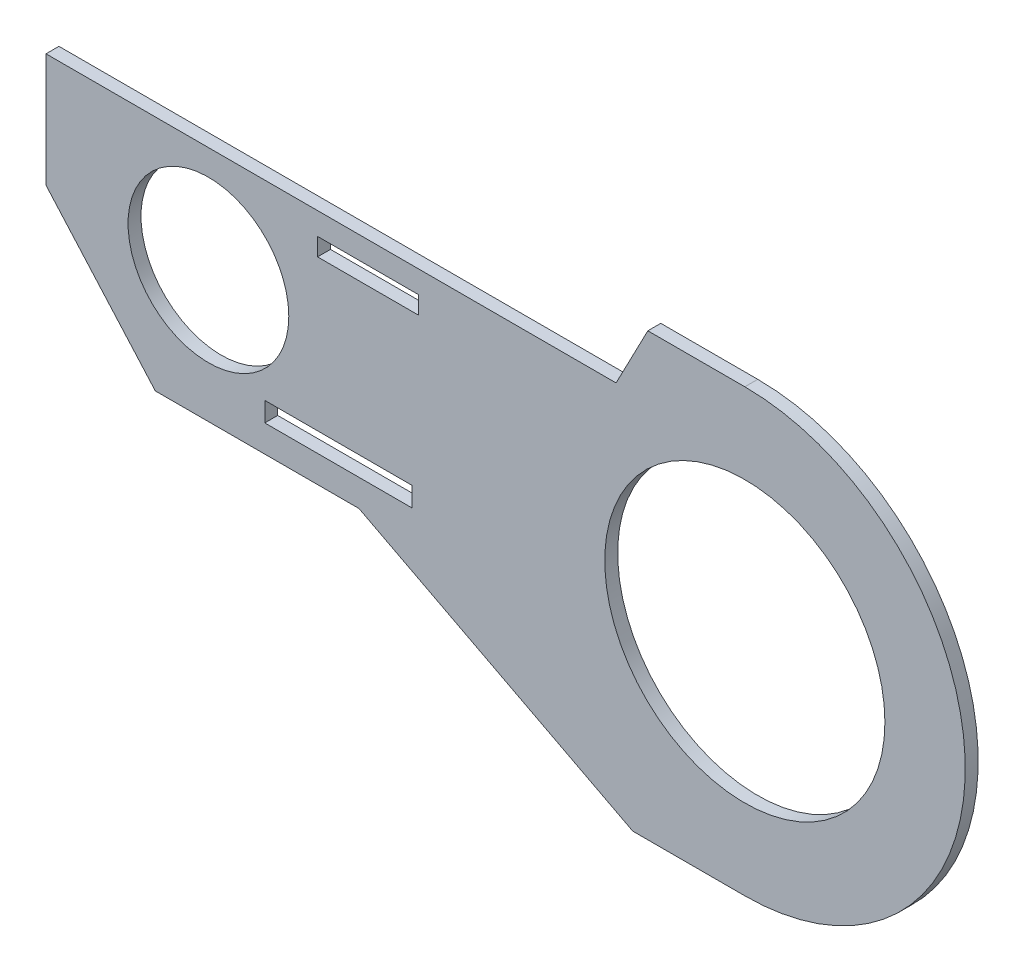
ISO-10303-21;
HEADER;
FILE_DESCRIPTION(('STEP AP214'),'2;1');
FILE_NAME('part.step','',(''),(''),'','','');
FILE_SCHEMA(('AUTOMOTIVE_DESIGN { 1 0 10303 214 1 1 1 1 }'));
ENDSEC;
DATA;
#1=APPLICATION_CONTEXT('core data for automotive mechanical design processes');
#2=APPLICATION_PROTOCOL_DEFINITION('international standard','automotive_design',2000,#1);
#3=PRODUCT_CONTEXT('',#1,'mechanical');
#4=PRODUCT('Part','Part','',(#3));
#5=PRODUCT_RELATED_PRODUCT_CATEGORY('part','',(#4));
#6=PRODUCT_DEFINITION_FORMATION('','',#4);
#7=PRODUCT_DEFINITION_CONTEXT('part definition',#1,'design');
#8=PRODUCT_DEFINITION('design','',#6,#7);
#9=PRODUCT_DEFINITION_SHAPE('','',#8);
#10=(LENGTH_UNIT() NAMED_UNIT(*) SI_UNIT(.MILLI.,.METRE.));
#11=(NAMED_UNIT(*) PLANE_ANGLE_UNIT() SI_UNIT($,.RADIAN.));
#12=(NAMED_UNIT(*) SI_UNIT($,.STERADIAN.) SOLID_ANGLE_UNIT());
#13=UNCERTAINTY_MEASURE_WITH_UNIT(LENGTH_MEASURE(1.E-05),#10,'distance_accuracy_value','');
#14=(GEOMETRIC_REPRESENTATION_CONTEXT(3) GLOBAL_UNCERTAINTY_ASSIGNED_CONTEXT((#13)) GLOBAL_UNIT_ASSIGNED_CONTEXT((#10,
#11,#12)) REPRESENTATION_CONTEXT('',''));
#15=CARTESIAN_POINT('',(0.,0.,0.));
#16=DIRECTION('',(0.,0.,1.));
#17=DIRECTION('',(1.,0.,0.));
#18=AXIS2_PLACEMENT_3D('',#15,#16,#17);
#19=CARTESIAN_POINT('',(360.895292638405,72.8829236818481,12.1));
#20=DIRECTION('',(0.,0.,-1.));
#21=DIRECTION('',(-1.,0.,0.));
#22=AXIS2_PLACEMENT_3D('',#19,#20,#21);
#23=PLANE('',#22);
#24=CARTESIAN_POINT('',(360.895292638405,72.8829236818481,12.1));
#25=DIRECTION('',(0.,0.,1.));
#26=DIRECTION('',(1.,0.,0.));
#27=AXIS2_PLACEMENT_3D('',#24,#25,#26);
#28=CIRCLE('',#27,131.026924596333);
#29=CARTESIAN_POINT('',(491.922217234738,72.8829236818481,12.1));
#30=VERTEX_POINT('',#29);
#31=EDGE_CURVE('E190',#30,#30,#28,.T.);
#32=ORIENTED_EDGE('',*,*,#31,.F.);
#33=EDGE_LOOP('',(#32));
#34=FACE_BOUND('',#33,.T.);
#35=CARTESIAN_POINT('',(-140.807894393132,122.8435308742,12.1));
#36=DIRECTION('',(0.,0.,1.));
#37=DIRECTION('',(1.,0.,0.));
#38=AXIS2_PLACEMENT_3D('',#35,#36,#37);
#39=CIRCLE('',#38,75.166609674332);
#40=CARTESIAN_POINT('',(-65.6412847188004,122.8435308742,12.1));
#41=VERTEX_POINT('',#40);
#42=EDGE_CURVE('E196',#41,#41,#39,.T.);
#43=ORIENTED_EDGE('',*,*,#42,.F.);
#44=EDGE_LOOP('',(#43));
#45=FACE_BOUND('',#44,.T.);
#46=DIRECTION('',(0.,1.,0.));
#47=VECTOR('',#46,1.);
#48=CARTESIAN_POINT('',(49.4156994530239,43.5664611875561,12.1));
#49=LINE('',#48,#47);
#50=CARTESIAN_POINT('',(49.4156994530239,25.2820023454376,12.1));
#51=VERTEX_POINT('',#50);
#52=CARTESIAN_POINT('',(49.4156994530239,43.5664611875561,12.1));
#53=VERTEX_POINT('',#52);
#54=EDGE_CURVE('E202',#51,#53,#49,.T.);
#55=ORIENTED_EDGE('',*,*,#54,.F.);
#56=DIRECTION('',(1.,0.,0.));
#57=VECTOR('',#56,1.);
#58=CARTESIAN_POINT('',(-88.1032874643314,25.2820023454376,12.1));
#59=LINE('',#58,#57);
#60=CARTESIAN_POINT('',(-88.1032874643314,25.2820023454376,12.1));
#61=VERTEX_POINT('',#60);
#62=EDGE_CURVE('E210',#61,#51,#59,.T.);
#63=ORIENTED_EDGE('',*,*,#62,.F.);
#64=DIRECTION('',(0.,-1.,0.));
#65=VECTOR('',#64,1.);
#66=CARTESIAN_POINT('',(-88.1032874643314,43.5664611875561,12.1));
#67=LINE('',#66,#65);
#68=CARTESIAN_POINT('',(-88.1032874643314,43.5664611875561,12.1));
#69=VERTEX_POINT('',#68);
#70=EDGE_CURVE('E207',#69,#61,#67,.T.);
#71=ORIENTED_EDGE('',*,*,#70,.F.);
#72=DIRECTION('',(-1.,0.,0.));
#73=VECTOR('',#72,1.);
#74=CARTESIAN_POINT('',(-88.1032874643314,43.5664611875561,12.1));
#75=LINE('',#74,#73);
#76=EDGE_CURVE('E204',#53,#69,#75,.T.);
#77=ORIENTED_EDGE('',*,*,#76,.F.);
#78=EDGE_LOOP('',(#55,#63,#71,#77));
#79=FACE_BOUND('',#78,.T.);
#80=DIRECTION('',(1.,0.,0.));
#81=VECTOR('',#80,1.);
#82=CARTESIAN_POINT('',(-190.489812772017,0.,12.1));
#83=LINE('',#82,#81);
#84=CARTESIAN_POINT('',(-190.489812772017,0.,12.1));
#85=VERTEX_POINT('',#84);
#86=CARTESIAN_POINT('',(0.,0.,12.1));
#87=VERTEX_POINT('',#86);
#88=EDGE_CURVE('E233',#85,#87,#83,.T.);
#89=ORIENTED_EDGE('',*,*,#88,.T.);
#90=DIRECTION('',(0.887044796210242,-0.461683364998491,0.));
#91=VECTOR('',#90,1.);
#92=CARTESIAN_POINT('',(0.,0.,12.1));
#93=LINE('',#92,#91);
#94=CARTESIAN_POINT('',(256.094013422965,-133.290163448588,12.1));
#95=VERTEX_POINT('',#94);
#96=EDGE_CURVE('E236',#87,#95,#93,.T.);
#97=ORIENTED_EDGE('',*,*,#96,.T.);
#98=DIRECTION('',(1.,0.,0.));
#99=VECTOR('',#98,1.);
#100=CARTESIAN_POINT('',(256.094013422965,-133.290163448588,12.1));
#101=LINE('',#100,#99);
#102=CARTESIAN_POINT('',(360.895292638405,-133.290163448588,12.1));
#103=VERTEX_POINT('',#102);
#104=EDGE_CURVE('E239',#95,#103,#101,.T.);
#105=ORIENTED_EDGE('',*,*,#104,.T.);
#106=CARTESIAN_POINT('',(360.895292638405,72.8829236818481,12.1));
#107=DIRECTION('',(0.,0.,1.));
#108=DIRECTION('',(-1.,0.,0.));
#109=AXIS2_PLACEMENT_3D('',#106,#107,#108);
#110=CIRCLE('',#109,206.173087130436);
#111=CARTESIAN_POINT('',(360.895292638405,279.056010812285,12.1));
#112=VERTEX_POINT('',#111);
#113=EDGE_CURVE('E241',#103,#112,#110,.T.);
#114=ORIENTED_EDGE('',*,*,#113,.T.);
#115=DIRECTION('',(-1.,0.,0.));
#116=VECTOR('',#115,1.);
#117=CARTESIAN_POINT('',(360.895292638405,279.056010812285,12.1));
#118=LINE('',#117,#116);
#119=CARTESIAN_POINT('',(270.184556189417,279.056010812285,12.1));
#120=VERTEX_POINT('',#119);
#121=EDGE_CURVE('E243',#112,#120,#118,.T.);
#122=ORIENTED_EDGE('',*,*,#121,.T.);
#123=DIRECTION('',(-0.461683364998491,-0.887044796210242,0.));
#124=VECTOR('',#123,1.);
#125=CARTESIAN_POINT('',(270.184556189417,279.056010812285,12.1));
#126=LINE('',#125,#124);
#127=CARTESIAN_POINT('',(240.473508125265,221.971366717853,12.1));
#128=VERTEX_POINT('',#127);
#129=EDGE_CURVE('E245',#120,#128,#126,.T.);
#130=ORIENTED_EDGE('',*,*,#129,.T.);
#131=DIRECTION('',(-1.,0.,0.));
#132=VECTOR('',#131,1.);
#133=CARTESIAN_POINT('',(240.473508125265,221.971366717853,12.1));
#134=LINE('',#133,#132);
#135=CARTESIAN_POINT('',(-292.728145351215,221.971366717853,12.1));
#136=VERTEX_POINT('',#135);
#137=EDGE_CURVE('E247',#128,#136,#134,.T.);
#138=ORIENTED_EDGE('',*,*,#137,.T.);
#139=DIRECTION('',(0.,-1.,0.));
#140=VECTOR('',#139,1.);
#141=CARTESIAN_POINT('',(-292.728145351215,221.971366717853,12.1));
#142=LINE('',#141,#140);
#143=CARTESIAN_POINT('',(-292.728145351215,115.500270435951,12.1));
#144=VERTEX_POINT('',#143);
#145=EDGE_CURVE('E249',#136,#144,#142,.T.);
#146=ORIENTED_EDGE('',*,*,#145,.T.);
#147=DIRECTION('',(0.662810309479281,-0.74878734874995,0.));
#148=VECTOR('',#147,1.);
#149=CARTESIAN_POINT('',(-292.728145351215,115.500270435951,12.1));
#150=LINE('',#149,#148);
#151=EDGE_CURVE('E251',#144,#85,#150,.T.);
#152=ORIENTED_EDGE('',*,*,#151,.T.);
#153=EDGE_LOOP('',(#89,#97,#105,#114,#122,#130,#138,#146,#152));
#154=FACE_BOUND('',#153,.T.);
#155=DIRECTION('',(0.,1.,0.));
#156=VECTOR('',#155,1.);
#157=CARTESIAN_POINT('',(55.6816381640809,201.057980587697,12.1));
#158=LINE('',#157,#156);
#159=CARTESIAN_POINT('',(55.6816381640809,184.471071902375,12.1));
#160=VERTEX_POINT('',#159);
#161=CARTESIAN_POINT('',(55.6816381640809,201.057980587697,12.1));
#162=VERTEX_POINT('',#161);
#163=EDGE_CURVE('E154',#160,#162,#158,.T.);
#164=ORIENTED_EDGE('',*,*,#163,.F.);
#165=DIRECTION('',(1.,0.,0.));
#166=VECTOR('',#165,1.);
#167=CARTESIAN_POINT('',(-38.736149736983,184.471071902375,12.1));
#168=LINE('',#167,#166);
#169=CARTESIAN_POINT('',(-38.736149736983,184.471071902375,12.1));
#170=VERTEX_POINT('',#169);
#171=EDGE_CURVE('E176',#170,#160,#168,.T.);
#172=ORIENTED_EDGE('',*,*,#171,.F.);
#173=DIRECTION('',(0.,-1.,0.));
#174=VECTOR('',#173,1.);
#175=CARTESIAN_POINT('',(-38.736149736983,201.057980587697,12.1));
#176=LINE('',#175,#174);
#177=CARTESIAN_POINT('',(-38.736149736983,201.057980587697,12.1));
#178=VERTEX_POINT('',#177);
#179=EDGE_CURVE('E174',#178,#170,#176,.T.);
#180=ORIENTED_EDGE('',*,*,#179,.F.);
#181=DIRECTION('',(-1.,0.,0.));
#182=VECTOR('',#181,1.);
#183=CARTESIAN_POINT('',(-38.736149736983,201.057980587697,12.1));
#184=LINE('',#183,#182);
#185=EDGE_CURVE('E162',#162,#178,#184,.T.);
#186=ORIENTED_EDGE('',*,*,#185,.F.);
#187=EDGE_LOOP('',(#164,#172,#180,#186));
#188=FACE_BOUND('',#187,.T.);
#189=ADVANCED_FACE('F35',(#34,#45,#79,#154,#188),#23,.F.);
#190=CARTESIAN_POINT('',(360.895292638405,72.8829236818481,0.));
#191=DIRECTION('',(0.,0.,-1.));
#192=DIRECTION('',(-1.,0.,0.));
#193=AXIS2_PLACEMENT_3D('',#190,#191,#192);
#194=PLANE('',#193);
#195=CARTESIAN_POINT('',(-140.807894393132,122.8435308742,0.));
#196=DIRECTION('',(0.,0.,1.));
#197=DIRECTION('',(1.,0.,0.));
#198=AXIS2_PLACEMENT_3D('',#195,#196,#197);
#199=CIRCLE('',#198,75.166609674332);
#200=CARTESIAN_POINT('',(-65.6412847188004,122.8435308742,0.));
#201=VERTEX_POINT('',#200);
#202=EDGE_CURVE('E193',#201,#201,#199,.T.);
#203=ORIENTED_EDGE('',*,*,#202,.T.);
#204=EDGE_LOOP('',(#203));
#205=FACE_BOUND('',#204,.T.);
#206=DIRECTION('',(1.,0.,0.));
#207=VECTOR('',#206,1.);
#208=CARTESIAN_POINT('',(-190.489812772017,0.,0.));
#209=LINE('',#208,#207);
#210=CARTESIAN_POINT('',(-190.489812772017,0.,0.));
#211=VERTEX_POINT('',#210);
#212=CARTESIAN_POINT('',(0.,0.,0.));
#213=VERTEX_POINT('',#212);
#214=EDGE_CURVE('E232',#211,#213,#209,.T.);
#215=ORIENTED_EDGE('',*,*,#214,.F.);
#216=DIRECTION('',(0.662810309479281,-0.74878734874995,0.));
#217=VECTOR('',#216,1.);
#218=CARTESIAN_POINT('',(-292.728145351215,115.500270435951,0.));
#219=LINE('',#218,#217);
#220=CARTESIAN_POINT('',(-292.728145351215,115.500270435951,0.));
#221=VERTEX_POINT('',#220);
#222=EDGE_CURVE('E237',#221,#211,#219,.T.);
#223=ORIENTED_EDGE('',*,*,#222,.F.);
#224=DIRECTION('',(0.,-1.,0.));
#225=VECTOR('',#224,1.);
#226=CARTESIAN_POINT('',(-292.728145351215,221.971366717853,0.));
#227=LINE('',#226,#225);
#228=CARTESIAN_POINT('',(-292.728145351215,221.971366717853,0.));
#229=VERTEX_POINT('',#228);
#230=EDGE_CURVE('E268',#229,#221,#227,.T.);
#231=ORIENTED_EDGE('',*,*,#230,.F.);
#232=DIRECTION('',(-1.,0.,0.));
#233=VECTOR('',#232,1.);
#234=CARTESIAN_POINT('',(240.473508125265,221.971366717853,0.));
#235=LINE('',#234,#233);
#236=CARTESIAN_POINT('',(240.473508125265,221.971366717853,0.));
#237=VERTEX_POINT('',#236);
#238=EDGE_CURVE('E266',#237,#229,#235,.T.);
#239=ORIENTED_EDGE('',*,*,#238,.F.);
#240=DIRECTION('',(-0.461683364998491,-0.887044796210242,0.));
#241=VECTOR('',#240,1.);
#242=CARTESIAN_POINT('',(270.184556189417,279.056010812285,0.));
#243=LINE('',#242,#241);
#244=CARTESIAN_POINT('',(270.184556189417,279.056010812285,0.));
#245=VERTEX_POINT('',#244);
#246=EDGE_CURVE('E264',#245,#237,#243,.T.);
#247=ORIENTED_EDGE('',*,*,#246,.F.);
#248=DIRECTION('',(-1.,0.,0.));
#249=VECTOR('',#248,1.);
#250=CARTESIAN_POINT('',(360.895292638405,279.056010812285,0.));
#251=LINE('',#250,#249);
#252=CARTESIAN_POINT('',(360.895292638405,279.056010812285,0.));
#253=VERTEX_POINT('',#252);
#254=EDGE_CURVE('E262',#253,#245,#251,.T.);
#255=ORIENTED_EDGE('',*,*,#254,.F.);
#256=CARTESIAN_POINT('',(360.895292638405,72.8829236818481,0.));
#257=DIRECTION('',(0.,0.,1.));
#258=DIRECTION('',(-1.,0.,0.));
#259=AXIS2_PLACEMENT_3D('',#256,#257,#258);
#260=CIRCLE('',#259,206.173087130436);
#261=CARTESIAN_POINT('',(360.895292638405,-133.290163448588,0.));
#262=VERTEX_POINT('',#261);
#263=EDGE_CURVE('E260',#262,#253,#260,.T.);
#264=ORIENTED_EDGE('',*,*,#263,.F.);
#265=DIRECTION('',(1.,0.,0.));
#266=VECTOR('',#265,1.);
#267=CARTESIAN_POINT('',(256.094013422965,-133.290163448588,0.));
#268=LINE('',#267,#266);
#269=CARTESIAN_POINT('',(256.094013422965,-133.290163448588,0.));
#270=VERTEX_POINT('',#269);
#271=EDGE_CURVE('E258',#270,#262,#268,.T.);
#272=ORIENTED_EDGE('',*,*,#271,.F.);
#273=DIRECTION('',(0.887044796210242,-0.461683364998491,0.));
#274=VECTOR('',#273,1.);
#275=CARTESIAN_POINT('',(0.,0.,0.));
#276=LINE('',#275,#274);
#277=EDGE_CURVE('E256',#213,#270,#276,.T.);
#278=ORIENTED_EDGE('',*,*,#277,.F.);
#279=EDGE_LOOP('',(#215,#223,#231,#239,#247,#255,#264,#272,#278));
#280=FACE_BOUND('',#279,.T.);
#281=DIRECTION('',(1.,0.,0.));
#282=VECTOR('',#281,1.);
#283=CARTESIAN_POINT('',(-88.1032874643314,25.2820023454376,0.));
#284=LINE('',#283,#282);
#285=CARTESIAN_POINT('',(-88.1032874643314,25.2820023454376,0.));
#286=VERTEX_POINT('',#285);
#287=CARTESIAN_POINT('',(49.415699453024,25.2820023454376,0.));
#288=VERTEX_POINT('',#287);
#289=EDGE_CURVE('E205',#286,#288,#284,.T.);
#290=ORIENTED_EDGE('',*,*,#289,.T.);
#291=DIRECTION('',(0.,1.,0.));
#292=VECTOR('',#291,1.);
#293=CARTESIAN_POINT('',(49.4156994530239,43.5664611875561,0.));
#294=LINE('',#293,#292);
#295=CARTESIAN_POINT('',(49.4156994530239,43.5664611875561,0.));
#296=VERTEX_POINT('',#295);
#297=EDGE_CURVE('E199',#288,#296,#294,.T.);
#298=ORIENTED_EDGE('',*,*,#297,.T.);
#299=DIRECTION('',(-1.,0.,0.));
#300=VECTOR('',#299,1.);
#301=CARTESIAN_POINT('',(-88.1032874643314,43.5664611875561,0.));
#302=LINE('',#301,#300);
#303=CARTESIAN_POINT('',(-88.1032874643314,43.5664611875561,0.));
#304=VERTEX_POINT('',#303);
#305=EDGE_CURVE('E215',#296,#304,#302,.T.);
#306=ORIENTED_EDGE('',*,*,#305,.T.);
#307=DIRECTION('',(0.,-1.,0.));
#308=VECTOR('',#307,1.);
#309=CARTESIAN_POINT('',(-88.1032874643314,43.5664611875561,0.));
#310=LINE('',#309,#308);
#311=EDGE_CURVE('E218',#304,#286,#310,.T.);
#312=ORIENTED_EDGE('',*,*,#311,.T.);
#313=EDGE_LOOP('',(#290,#298,#306,#312));
#314=FACE_BOUND('',#313,.T.);
#315=CARTESIAN_POINT('',(360.895292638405,72.8829236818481,0.));
#316=DIRECTION('',(0.,0.,1.));
#317=DIRECTION('',(1.,0.,0.));
#318=AXIS2_PLACEMENT_3D('',#315,#316,#317);
#319=CIRCLE('',#318,131.026924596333);
#320=CARTESIAN_POINT('',(491.922217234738,72.8829236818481,0.));
#321=VERTEX_POINT('',#320);
#322=EDGE_CURVE('E170',#321,#321,#319,.T.);
#323=ORIENTED_EDGE('',*,*,#322,.T.);
#324=EDGE_LOOP('',(#323));
#325=FACE_BOUND('',#324,.T.);
#326=DIRECTION('',(1.,0.,0.));
#327=VECTOR('',#326,1.);
#328=CARTESIAN_POINT('',(-38.736149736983,184.471071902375,0.));
#329=LINE('',#328,#327);
#330=CARTESIAN_POINT('',(-38.736149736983,184.471071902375,0.));
#331=VERTEX_POINT('',#330);
#332=CARTESIAN_POINT('',(55.681638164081,184.471071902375,0.));
#333=VERTEX_POINT('',#332);
#334=EDGE_CURVE('E163',#331,#333,#329,.T.);
#335=ORIENTED_EDGE('',*,*,#334,.T.);
#336=DIRECTION('',(0.,1.,0.));
#337=VECTOR('',#336,1.);
#338=CARTESIAN_POINT('',(55.6816381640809,201.057980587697,0.));
#339=LINE('',#338,#337);
#340=CARTESIAN_POINT('',(55.6816381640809,201.057980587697,0.));
#341=VERTEX_POINT('',#340);
#342=EDGE_CURVE('E58',#333,#341,#339,.T.);
#343=ORIENTED_EDGE('',*,*,#342,.T.);
#344=DIRECTION('',(-1.,0.,0.));
#345=VECTOR('',#344,1.);
#346=CARTESIAN_POINT('',(-38.736149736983,201.057980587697,0.));
#347=LINE('',#346,#345);
#348=CARTESIAN_POINT('',(-38.736149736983,201.057980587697,0.));
#349=VERTEX_POINT('',#348);
#350=EDGE_CURVE('E169',#341,#349,#347,.T.);
#351=ORIENTED_EDGE('',*,*,#350,.T.);
#352=DIRECTION('',(0.,-1.,0.));
#353=VECTOR('',#352,1.);
#354=CARTESIAN_POINT('',(-38.736149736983,201.057980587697,0.));
#355=LINE('',#354,#353);
#356=EDGE_CURVE('E182',#349,#331,#355,.T.);
#357=ORIENTED_EDGE('',*,*,#356,.T.);
#358=EDGE_LOOP('',(#335,#343,#351,#357));
#359=FACE_BOUND('',#358,.T.);
#360=ADVANCED_FACE('F301',(#205,#280,#314,#325,#359),#194,.T.);
#361=CARTESIAN_POINT('',(-190.489812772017,0.,12.1));
#362=DIRECTION('',(0.,1.,0.));
#363=DIRECTION('',(-1.,0.,0.));
#364=AXIS2_PLACEMENT_3D('',#361,#362,#363);
#365=PLANE('',#364);
#366=ORIENTED_EDGE('',*,*,#214,.T.);
#367=DIRECTION('',(0.,0.,-1.));
#368=VECTOR('',#367,1.);
#369=CARTESIAN_POINT('',(0.,0.,12.1));
#370=LINE('',#369,#368);
#371=EDGE_CURVE('E11',#87,#213,#370,.T.);
#372=ORIENTED_EDGE('',*,*,#371,.F.);
#373=ORIENTED_EDGE('',*,*,#88,.F.);
#374=DIRECTION('',(0.,0.,-1.));
#375=VECTOR('',#374,1.);
#376=CARTESIAN_POINT('',(-190.489812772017,0.,12.1));
#377=LINE('',#376,#375);
#378=EDGE_CURVE('E253',#85,#211,#377,.T.);
#379=ORIENTED_EDGE('',*,*,#378,.T.);
#380=EDGE_LOOP('',(#366,#372,#373,#379));
#381=FACE_BOUND('',#380,.T.);
#382=ADVANCED_FACE('F37',(#381),#365,.F.);
#383=CARTESIAN_POINT('',(0.,0.,12.1));
#384=DIRECTION('',(0.461683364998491,0.887044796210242,0.));
#385=DIRECTION('',(-0.887044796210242,0.461683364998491,0.));
#386=AXIS2_PLACEMENT_3D('',#383,#384,#385);
#387=PLANE('',#386);
#388=ORIENTED_EDGE('',*,*,#277,.T.);
#389=DIRECTION('',(0.,0.,-1.));
#390=VECTOR('',#389,1.);
#391=CARTESIAN_POINT('',(256.094013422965,-133.290163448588,12.1));
#392=LINE('',#391,#390);
#393=EDGE_CURVE('E43',#95,#270,#392,.T.);
#394=ORIENTED_EDGE('',*,*,#393,.F.);
#395=ORIENTED_EDGE('',*,*,#96,.F.);
#396=ORIENTED_EDGE('',*,*,#371,.T.);
#397=EDGE_LOOP('',(#388,#394,#395,#396));
#398=FACE_BOUND('',#397,.T.);
#399=ADVANCED_FACE('F318',(#398),#387,.F.);
#400=CARTESIAN_POINT('',(256.094013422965,-133.290163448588,12.1));
#401=DIRECTION('',(0.,1.,0.));
#402=DIRECTION('',(0.,0.,1.));
#403=AXIS2_PLACEMENT_3D('',#400,#401,#402);
#404=PLANE('',#403);
#405=ORIENTED_EDGE('',*,*,#271,.T.);
#406=DIRECTION('',(0.,0.,-1.));
#407=VECTOR('',#406,1.);
#408=CARTESIAN_POINT('',(360.895292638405,-133.290163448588,12.1));
#409=LINE('',#408,#407);
#410=EDGE_CURVE('E288',#103,#262,#409,.T.);
#411=ORIENTED_EDGE('',*,*,#410,.F.);
#412=ORIENTED_EDGE('',*,*,#104,.F.);
#413=ORIENTED_EDGE('',*,*,#393,.T.);
#414=EDGE_LOOP('',(#405,#411,#412,#413));
#415=FACE_BOUND('',#414,.T.);
#416=ADVANCED_FACE('F295',(#415),#404,.F.);
#417=CARTESIAN_POINT('',(360.895292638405,72.8829236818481,12.1));
#418=DIRECTION('',(0.,0.,-1.));
#419=DIRECTION('',(-1.,0.,0.));
#420=AXIS2_PLACEMENT_3D('',#417,#418,#419);
#421=CYLINDRICAL_SURFACE('',#420,206.173087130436);
#422=ORIENTED_EDGE('',*,*,#263,.T.);
#423=DIRECTION('',(0.,0.,-1.));
#424=VECTOR('',#423,1.);
#425=CARTESIAN_POINT('',(360.895292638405,279.056010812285,12.1));
#426=LINE('',#425,#424);
#427=EDGE_CURVE('E285',#112,#253,#426,.T.);
#428=ORIENTED_EDGE('',*,*,#427,.F.);
#429=ORIENTED_EDGE('',*,*,#113,.F.);
#430=ORIENTED_EDGE('',*,*,#410,.T.);
#431=EDGE_LOOP('',(#422,#428,#429,#430));
#432=FACE_BOUND('',#431,.T.);
#433=ADVANCED_FACE('F307',(#432),#421,.T.);
#434=CARTESIAN_POINT('',(360.895292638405,279.056010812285,12.1));
#435=DIRECTION('',(0.,-1.,0.));
#436=DIRECTION('',(1.,0.,0.));
#437=AXIS2_PLACEMENT_3D('',#434,#435,#436);
#438=PLANE('',#437);
#439=ORIENTED_EDGE('',*,*,#254,.T.);
#440=DIRECTION('',(0.,0.,-1.));
#441=VECTOR('',#440,1.);
#442=CARTESIAN_POINT('',(270.184556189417,279.056010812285,12.1));
#443=LINE('',#442,#441);
#444=EDGE_CURVE('E282',#120,#245,#443,.T.);
#445=ORIENTED_EDGE('',*,*,#444,.F.);
#446=ORIENTED_EDGE('',*,*,#121,.F.);
#447=ORIENTED_EDGE('',*,*,#427,.T.);
#448=EDGE_LOOP('',(#439,#445,#446,#447));
#449=FACE_BOUND('',#448,.T.);
#450=ADVANCED_FACE('F311',(#449),#438,.F.);
#451=CARTESIAN_POINT('',(270.184556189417,279.056010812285,12.1));
#452=DIRECTION('',(0.887044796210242,-0.461683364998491,0.));
#453=DIRECTION('',(0.461683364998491,0.887044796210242,0.));
#454=AXIS2_PLACEMENT_3D('',#451,#452,#453);
#455=PLANE('',#454);
#456=ORIENTED_EDGE('',*,*,#246,.T.);
#457=DIRECTION('',(0.,0.,-1.));
#458=VECTOR('',#457,1.);
#459=CARTESIAN_POINT('',(240.473508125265,221.971366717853,12.1));
#460=LINE('',#459,#458);
#461=EDGE_CURVE('E279',#128,#237,#460,.T.);
#462=ORIENTED_EDGE('',*,*,#461,.F.);
#463=ORIENTED_EDGE('',*,*,#129,.F.);
#464=ORIENTED_EDGE('',*,*,#444,.T.);
#465=EDGE_LOOP('',(#456,#462,#463,#464));
#466=FACE_BOUND('',#465,.T.);
#467=ADVANCED_FACE('F336',(#466),#455,.F.);
#468=CARTESIAN_POINT('',(240.473508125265,221.971366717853,12.1));
#469=DIRECTION('',(0.,-1.,0.));
#470=DIRECTION('',(0.,0.,-1.));
#471=AXIS2_PLACEMENT_3D('',#468,#469,#470);
#472=PLANE('',#471);
#473=ORIENTED_EDGE('',*,*,#238,.T.);
#474=DIRECTION('',(0.,0.,-1.));
#475=VECTOR('',#474,1.);
#476=CARTESIAN_POINT('',(-292.728145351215,221.971366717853,12.1));
#477=LINE('',#476,#475);
#478=EDGE_CURVE('E276',#136,#229,#477,.T.);
#479=ORIENTED_EDGE('',*,*,#478,.F.);
#480=ORIENTED_EDGE('',*,*,#137,.F.);
#481=ORIENTED_EDGE('',*,*,#461,.T.);
#482=EDGE_LOOP('',(#473,#479,#480,#481));
#483=FACE_BOUND('',#482,.T.);
#484=ADVANCED_FACE('F334',(#483),#472,.F.);
#485=CARTESIAN_POINT('',(-292.728145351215,221.971366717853,12.1));
#486=DIRECTION('',(1.,0.,0.));
#487=DIRECTION('',(0.,0.,-1.));
#488=AXIS2_PLACEMENT_3D('',#485,#486,#487);
#489=PLANE('',#488);
#490=ORIENTED_EDGE('',*,*,#230,.T.);
#491=DIRECTION('',(0.,0.,-1.));
#492=VECTOR('',#491,1.);
#493=CARTESIAN_POINT('',(-292.728145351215,115.500270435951,12.1));
#494=LINE('',#493,#492);
#495=EDGE_CURVE('E273',#144,#221,#494,.T.);
#496=ORIENTED_EDGE('',*,*,#495,.F.);
#497=ORIENTED_EDGE('',*,*,#145,.F.);
#498=ORIENTED_EDGE('',*,*,#478,.T.);
#499=EDGE_LOOP('',(#490,#496,#497,#498));
#500=FACE_BOUND('',#499,.T.);
#501=ADVANCED_FACE('F330',(#500),#489,.F.);
#502=CARTESIAN_POINT('',(-292.728145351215,115.500270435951,12.1));
#503=DIRECTION('',(0.74878734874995,0.662810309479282,0.));
#504=DIRECTION('',(-0.662810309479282,0.74878734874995,0.));
#505=AXIS2_PLACEMENT_3D('',#502,#503,#504);
#506=PLANE('',#505);
#507=ORIENTED_EDGE('',*,*,#222,.T.);
#508=ORIENTED_EDGE('',*,*,#378,.F.);
#509=ORIENTED_EDGE('',*,*,#151,.F.);
#510=ORIENTED_EDGE('',*,*,#495,.T.);
#511=EDGE_LOOP('',(#507,#508,#509,#510));
#512=FACE_BOUND('',#511,.T.);
#513=ADVANCED_FACE('F325',(#512),#506,.F.);
#514=CARTESIAN_POINT('',(49.4156994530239,43.5664611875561,12.1));
#515=DIRECTION('',(-1.,0.,0.));
#516=DIRECTION('',(0.,0.,1.));
#517=AXIS2_PLACEMENT_3D('',#514,#515,#516);
#518=PLANE('',#517);
#519=ORIENTED_EDGE('',*,*,#297,.F.);
#520=DIRECTION('',(0.,0.,-1.));
#521=VECTOR('',#520,1.);
#522=CARTESIAN_POINT('',(49.4156994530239,25.2820023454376,12.1));
#523=LINE('',#522,#521);
#524=EDGE_CURVE('E212',#51,#288,#523,.T.);
#525=ORIENTED_EDGE('',*,*,#524,.F.);
#526=ORIENTED_EDGE('',*,*,#54,.T.);
#527=DIRECTION('',(0.,0.,-1.));
#528=VECTOR('',#527,1.);
#529=CARTESIAN_POINT('',(49.4156994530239,43.5664611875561,12.1));
#530=LINE('',#529,#528);
#531=EDGE_CURVE('E229',#53,#296,#530,.T.);
#532=ORIENTED_EDGE('',*,*,#531,.T.);
#533=EDGE_LOOP('',(#519,#525,#526,#532));
#534=FACE_BOUND('',#533,.T.);
#535=ADVANCED_FACE('F356',(#534),#518,.T.);
#536=CARTESIAN_POINT('',(-88.1032874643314,43.5664611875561,12.1));
#537=DIRECTION('',(0.,-1.,0.));
#538=DIRECTION('',(0.,0.,-1.));
#539=AXIS2_PLACEMENT_3D('',#536,#537,#538);
#540=PLANE('',#539);
#541=ORIENTED_EDGE('',*,*,#305,.F.);
#542=ORIENTED_EDGE('',*,*,#531,.F.);
#543=ORIENTED_EDGE('',*,*,#76,.T.);
#544=DIRECTION('',(0.,0.,-1.));
#545=VECTOR('',#544,1.);
#546=CARTESIAN_POINT('',(-88.1032874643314,43.5664611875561,12.1));
#547=LINE('',#546,#545);
#548=EDGE_CURVE('E227',#69,#304,#547,.T.);
#549=ORIENTED_EDGE('',*,*,#548,.T.);
#550=EDGE_LOOP('',(#541,#542,#543,#549));
#551=FACE_BOUND('',#550,.T.);
#552=ADVANCED_FACE('F376',(#551),#540,.T.);
#553=CARTESIAN_POINT('',(-88.1032874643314,43.5664611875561,12.1));
#554=DIRECTION('',(1.,0.,0.));
#555=DIRECTION('',(0.,0.,-1.));
#556=AXIS2_PLACEMENT_3D('',#553,#554,#555);
#557=PLANE('',#556);
#558=ORIENTED_EDGE('',*,*,#311,.F.);
#559=ORIENTED_EDGE('',*,*,#548,.F.);
#560=ORIENTED_EDGE('',*,*,#70,.T.);
#561=DIRECTION('',(0.,0.,-1.));
#562=VECTOR('',#561,1.);
#563=CARTESIAN_POINT('',(-88.1032874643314,25.2820023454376,12.1));
#564=LINE('',#563,#562);
#565=EDGE_CURVE('E225',#61,#286,#564,.T.);
#566=ORIENTED_EDGE('',*,*,#565,.T.);
#567=EDGE_LOOP('',(#558,#559,#560,#566));
#568=FACE_BOUND('',#567,.T.);
#569=ADVANCED_FACE('F383',(#568),#557,.T.);
#570=CARTESIAN_POINT('',(-88.1032874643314,25.2820023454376,12.1));
#571=DIRECTION('',(0.,1.,0.));
#572=DIRECTION('',(0.,0.,1.));
#573=AXIS2_PLACEMENT_3D('',#570,#571,#572);
#574=PLANE('',#573);
#575=ORIENTED_EDGE('',*,*,#289,.F.);
#576=ORIENTED_EDGE('',*,*,#565,.F.);
#577=ORIENTED_EDGE('',*,*,#62,.T.);
#578=ORIENTED_EDGE('',*,*,#524,.T.);
#579=EDGE_LOOP('',(#575,#576,#577,#578));
#580=FACE_BOUND('',#579,.T.);
#581=ADVANCED_FACE('F390',(#580),#574,.T.);
#582=CARTESIAN_POINT('',(-140.807894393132,122.8435308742,12.1));
#583=DIRECTION('',(0.,0.,-1.));
#584=DIRECTION('',(-1.,0.,0.));
#585=AXIS2_PLACEMENT_3D('',#582,#583,#584);
#586=CYLINDRICAL_SURFACE('',#585,75.166609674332);
#587=ORIENTED_EDGE('',*,*,#42,.T.);
#588=EDGE_LOOP('',(#587));
#589=FACE_BOUND('',#588,.T.);
#590=ORIENTED_EDGE('',*,*,#202,.F.);
#591=EDGE_LOOP('',(#590));
#592=FACE_BOUND('',#591,.T.);
#593=ADVANCED_FACE('F398',(#589,#592),#586,.F.);
#594=CARTESIAN_POINT('',(360.895292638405,72.8829236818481,12.1));
#595=DIRECTION('',(0.,0.,-1.));
#596=DIRECTION('',(-1.,0.,0.));
#597=AXIS2_PLACEMENT_3D('',#594,#595,#596);
#598=CYLINDRICAL_SURFACE('',#597,131.026924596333);
#599=ORIENTED_EDGE('',*,*,#31,.T.);
#600=EDGE_LOOP('',(#599));
#601=FACE_BOUND('',#600,.T.);
#602=ORIENTED_EDGE('',*,*,#322,.F.);
#603=EDGE_LOOP('',(#602));
#604=FACE_BOUND('',#603,.T.);
#605=ADVANCED_FACE('F406',(#601,#604),#598,.F.);
#606=CARTESIAN_POINT('',(55.6816381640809,201.057980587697,12.1));
#607=DIRECTION('',(-1.,0.,0.));
#608=DIRECTION('',(0.,0.,1.));
#609=AXIS2_PLACEMENT_3D('',#606,#607,#608);
#610=PLANE('',#609);
#611=ORIENTED_EDGE('',*,*,#342,.F.);
#612=DIRECTION('',(0.,0.,-1.));
#613=VECTOR('',#612,1.);
#614=CARTESIAN_POINT('',(55.6816381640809,184.471071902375,12.1));
#615=LINE('',#614,#613);
#616=EDGE_CURVE('E158',#160,#333,#615,.T.);
#617=ORIENTED_EDGE('',*,*,#616,.F.);
#618=ORIENTED_EDGE('',*,*,#163,.T.);
#619=DIRECTION('',(0.,0.,-1.));
#620=VECTOR('',#619,1.);
#621=CARTESIAN_POINT('',(55.6816381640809,201.057980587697,12.1));
#622=LINE('',#621,#620);
#623=EDGE_CURVE('E157',#162,#341,#622,.T.);
#624=ORIENTED_EDGE('',*,*,#623,.T.);
#625=EDGE_LOOP('',(#611,#617,#618,#624));
#626=FACE_BOUND('',#625,.T.);
#627=ADVANCED_FACE('F156',(#626),#610,.T.);
#628=CARTESIAN_POINT('',(-38.736149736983,201.057980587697,12.1));
#629=DIRECTION('',(0.,-1.,0.));
#630=DIRECTION('',(0.,0.,-1.));
#631=AXIS2_PLACEMENT_3D('',#628,#629,#630);
#632=PLANE('',#631);
#633=ORIENTED_EDGE('',*,*,#350,.F.);
#634=ORIENTED_EDGE('',*,*,#623,.F.);
#635=ORIENTED_EDGE('',*,*,#185,.T.);
#636=DIRECTION('',(0.,0.,-1.));
#637=VECTOR('',#636,1.);
#638=CARTESIAN_POINT('',(-38.736149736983,201.057980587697,12.1));
#639=LINE('',#638,#637);
#640=EDGE_CURVE('E171',#178,#349,#639,.T.);
#641=ORIENTED_EDGE('',*,*,#640,.T.);
#642=EDGE_LOOP('',(#633,#634,#635,#641));
#643=FACE_BOUND('',#642,.T.);
#644=ADVANCED_FACE('F166',(#643),#632,.T.);
#645=CARTESIAN_POINT('',(-38.736149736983,201.057980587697,12.1));
#646=DIRECTION('',(1.,0.,0.));
#647=DIRECTION('',(0.,0.,-1.));
#648=AXIS2_PLACEMENT_3D('',#645,#646,#647);
#649=PLANE('',#648);
#650=ORIENTED_EDGE('',*,*,#356,.F.);
#651=ORIENTED_EDGE('',*,*,#640,.F.);
#652=ORIENTED_EDGE('',*,*,#179,.T.);
#653=DIRECTION('',(0.,0.,-1.));
#654=VECTOR('',#653,1.);
#655=CARTESIAN_POINT('',(-38.736149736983,184.471071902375,12.1));
#656=LINE('',#655,#654);
#657=EDGE_CURVE('E50',#170,#331,#656,.T.);
#658=ORIENTED_EDGE('',*,*,#657,.T.);
#659=EDGE_LOOP('',(#650,#651,#652,#658));
#660=FACE_BOUND('',#659,.T.);
#661=ADVANCED_FACE('F427',(#660),#649,.T.);
#662=CARTESIAN_POINT('',(-38.736149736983,184.471071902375,12.1));
#663=DIRECTION('',(0.,1.,0.));
#664=DIRECTION('',(0.,0.,1.));
#665=AXIS2_PLACEMENT_3D('',#662,#663,#664);
#666=PLANE('',#665);
#667=ORIENTED_EDGE('',*,*,#334,.F.);
#668=ORIENTED_EDGE('',*,*,#657,.F.);
#669=ORIENTED_EDGE('',*,*,#171,.T.);
#670=ORIENTED_EDGE('',*,*,#616,.T.);
#671=EDGE_LOOP('',(#667,#668,#669,#670));
#672=FACE_BOUND('',#671,.T.);
#673=ADVANCED_FACE('F434',(#672),#666,.T.);
#674=CLOSED_SHELL('',(#189,#360,#382,#399,#416,#433,#450,#467,#484,#501,#513,#535,#552,#569,
#581,#593,#605,#627,#644,#661,#673));
#675=MANIFOLD_SOLID_BREP('B2',#674);
#676=ADVANCED_BREP_SHAPE_REPRESENTATION('',(#18,#675),#14);
#677=SHAPE_DEFINITION_REPRESENTATION(#9,#676);
ENDSEC;
END-ISO-10303-21;
